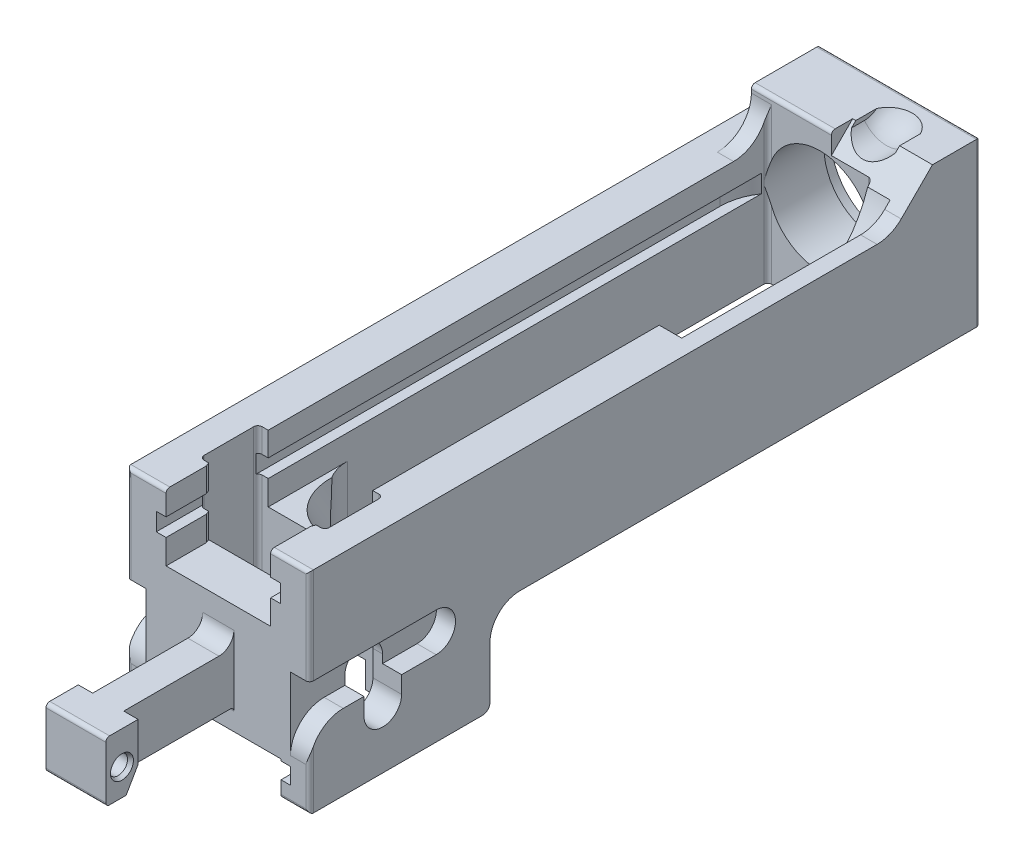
from build123d import *

# Parameters (mm, degrees)
EXTRUDE_1_DEPTH      = 19.3802
SKETCH_2_R           = 1.9812
EXTRUDE_2_DEPTH      = 3.302
SKETCH_3_R           = 1.9812
EXTRUDE_3_DEPTH      = 6.35
FILLET_1_R           = 0.79375
CUT_EXTRUDE_1_DEPTH  = 182.801214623
CUT_EXTRUDE_2_DEPTH  = 182.801214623
CUT_EXTRUDE_3_DEPTH  = 14.1224
CUT_EXTRUDE_4_REACH  = 150.552
CUT_EXTRUDE_5_DEPTH  = 3.7846
FILLET_2_R           = 0.79375
CUT_EXTRUDE_6_DEPTH  = 4.064
CHAMFER_1_SIZE       = 0.79375
CHAMFER_1_SIZE2      = 0.458271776
SKETCH_13_W          = 19.177
SKETCH_13_H          = 22.9616
CUT_EXTRUDE_8_DEPTH  = 12.827
SKETCH_14_W          = 4.826
SKETCH_14_H          = 8.763
CUT_EXTRUDE_9_DEPTH  = 178.762725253
CUT_EXTRUDE_10_DEPTH = 26.5684
SKETCH_16_R          = 23.876
CUT_EXTRUDE_11_DEPTH = 4.7752
CUT_EXTRUDE_12_DEPTH = 16.9418
CUT_EXTRUDE_13_DEPTH = 2.032
CUT_EXTRUDE_14_DEPTH = 1.3208


with BuildPart() as part:
    # Sketch 1 → Extrude 1 (new, symmetric)
    with BuildSketch(Plane(origin=(0, 0, 0), x_dir=(0, 0, -1), z_dir=(1, 0, 0))):
        with BuildLine():
            Line((-142.4178, 7.1882), (-21.8948, 7.1882))
            ThreePointArc((-21.8948, 7.1882), (-16.776054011, 9.308454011), (-14.6558, 14.4272))
            Line((-14.6558, 14.4272), (-14.6558, 15.15745))
            ThreePointArc((-14.6558, 15.15745), (-14.423316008, 15.718716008), (-13.86205, 15.9512))
            Line((-13.86205, 15.9512), (0, 15.9512))
            Line((0, 15.9512), (0, -18.5928))
            Line((0, -18.5928), (-97.7646, -18.5928))
            ThreePointArc((-97.7646, -18.5928), (-102.254728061, -20.452671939), (-104.1146, -24.9428))
            Line((-104.1146, -24.9428), (-104.1146, -35.9537))
            ThreePointArc((-104.1146, -35.9537), (-104.579567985, -37.076232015), (-105.7021, -37.5412))
            Line((-105.7021, -37.5412), (-142.4178, -37.5412))
            Line((-142.4178, -37.5412), (-142.4178, 7.1882))
        make_face()
        with BuildLine():
            Line((-130.8735, -25.0825), (-130.8735, -19.6723))
            ThreePointArc((-130.8735, -19.6723), (-126.873, -15.6718), (-122.8725, -19.6723))
            Line((-122.8725, -19.6723), (-122.8725, -25.0825))
            ThreePointArc((-122.8725, -25.0825), (-126.873, -29.083), (-130.8735, -25.0825))
        make_face(mode=Mode.SUBTRACT)
    extrude(amount=EXTRUDE_1_DEPTH, both=True)

    # Sketch 2 → Extrude 2 (add, symmetric)
    with BuildSketch(Plane(origin=(0, 0, 0), x_dir=(0, 0, -1), z_dir=(1, 0, 0))):
        with BuildLine():
            Line((-142.4178, -11.557), (-142.4178, -26.44775))
            ThreePointArc((-142.4178, -26.44775), (-142.650283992, -25.886483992), (-143.21155, -25.654))
            Line((-143.21155, -25.654), (-163.9444647, -25.654))
            ThreePointArc((-163.9444647, -25.654), (-166.320417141, -26.115252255), (-168.3512, -27.432))
            Line((-168.3512, -27.432), (-172.6692, -27.432))
            Line((-172.6692, -27.432), (-172.6692, -14.732))
            Line((-172.6692, -14.732), (-145.5928, -14.732))
            ThreePointArc((-145.5928, -14.732), (-143.34773597, -13.80206403), (-142.4178, -11.557))
        make_face()
        with Locations(Location((-169.2402, -21.7678, 0), (0, 0, 180))):
            Circle(SKETCH_2_R, mode=Mode.SUBTRACT)
    extrude(amount=EXTRUDE_2_DEPTH, both=True)

    # Sketch 3 → Extrude 3 (add, symmetric)
    with BuildSketch(Plane(origin=(0, 0, 0), x_dir=(0, 0, -1), z_dir=(1, 0, 0))):
        Polygon((-165.8112, -14.732), (-172.6692, -14.732), (-172.6692, -27.432), (-168.3512, -27.432), (-165.8112, -23.032590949), align=None)
        with Locations(Location((-169.2402, -21.7678, 0), (0, 0, 180))):
            Circle(SKETCH_3_R, mode=Mode.SUBTRACT)
    extrude(amount=EXTRUDE_3_DEPTH, both=True)

    # Fillet 1
    fillet_1_edges = [part.edges().sort_by_distance(p)[0] for p in [
        (0, -14.732, 172.6692),
        (0, -27.432, 172.6692),
    ]]
    fillet(fillet_1_edges, radius=FILLET_1_R)

    # Sketch 6 → Cut-Extrude 1 (cut, through all)
    with BuildSketch(Plane.XZ.offset(37.5412)):
        with BuildLine():
            Line((12.3952, 120.7262), (-12.3952, 120.7262))
            ThreePointArc((-12.3952, 120.7262), (-13.023817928, 120.986582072), (-13.2842, 121.6152))
            Line((-13.2842, 121.6152), (-13.2842, 132.1816))
            ThreePointArc((-13.2842, 132.1816), (-13.023817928, 132.810217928), (-12.3952, 133.0706))
            Line((-12.3952, 133.0706), (12.3952, 133.0706))
            ThreePointArc((12.3952, 133.0706), (13.023817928, 132.810217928), (13.2842, 132.1816))
            Line((13.2842, 132.1816), (13.2842, 121.6152))
            ThreePointArc((13.2842, 121.6152), (13.023817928, 120.986582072), (12.3952, 120.7262))
        make_face()
    extrude(amount=-CUT_EXTRUDE_1_DEPTH, mode=Mode.SUBTRACT)

    # Sketch 5 → Cut-Extrude 2 (cut, through all)
    with BuildSketch(Plane(origin=(0, 15.9512, 0), x_dir=(1, 0, 0), z_dir=(0, 1, 0))):
        with BuildLine():
            Line((-10.30605, -14.6558), (10.30605, -14.6558))
            ThreePointArc((10.30605, -14.6558), (10.867316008, -14.888283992), (11.0998, -15.44955))
            Line((11.0998, -15.44955), (11.0998, -103.91775))
            ThreePointArc((11.0998, -103.91775), (8.542476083, -110.091676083), (2.36855, -112.649))
            Line((2.36855, -112.649), (-2.36855, -112.649))
            ThreePointArc((-2.36855, -112.649), (-8.542476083, -110.091676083), (-11.0998, -103.91775))
            Line((-11.0998, -103.91775), (-11.0998, -15.44955))
            ThreePointArc((-11.0998, -15.44955), (-10.867316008, -14.888283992), (-10.30605, -14.6558))
        make_face()
    extrude(amount=-CUT_EXTRUDE_2_DEPTH, mode=Mode.SUBTRACT)

    # Sketch 7 → Cut-Revolve 1 (revolve, cut)
    with BuildSketch(Plane(origin=(0, 0, 0), x_dir=(0, 0, -1), z_dir=(1, 0, 0)), mode=Mode.PRIVATE) as cut_revolve_1_sk:
        Polygon((0, 0), (0, 12.3571), (-2.667, 12.3571), (-2.667, 11.10996), (-15.44955, 11.10996), (-15.44955, 0), align=None)
    revolve(cut_revolve_1_sk.sketch.rotate(Axis((0, 0, 0), (0, 0, 1)), 90), axis=Axis((0, 0, 0), (0, 0, 1)), mode=Mode.SUBTRACT)

    # Sketch 8 → Cut-Extrude 3 (cut)
    with BuildSketch(Plane(origin=(0, 7.1882, 0), x_dir=(1, 0, 0), z_dir=(0, 1, 0))):
        with BuildLine():
            Line((-11.0998, -103.91775), (11.0998, -103.91775))
            Line((11.0998, -103.91775), (11.0998, -120.7262))
            Line((11.0998, -120.7262), (11.89355, -120.7262))
            Line((11.89355, -120.7262), (11.89355, -130.057658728))
            ThreePointArc((11.89355, -130.057658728), (11.693001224, -132.001941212), (11.0998, -133.86435))
            Line((11.0998, -133.86435), (11.0998, -142.4178))
            Line((11.0998, -142.4178), (-11.0998, -142.4178))
            Line((-11.0998, -142.4178), (-11.0998, -133.86435))
            ThreePointArc((-11.0998, -133.86435), (-11.693001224, -132.001941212), (-11.89355, -130.057658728))
            Line((-11.89355, -130.057658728), (-11.89355, -120.7262))
            Line((-11.89355, -120.7262), (-11.0998, -120.7262))
            Line((-11.0998, -120.7262), (-11.0998, -103.91775))
        make_face()
    extrude(amount=-CUT_EXTRUDE_3_DEPTH, mode=Mode.SUBTRACT)

    # Cut-Extrude 4: up to this face of the body (flat: up to its plane)
    cut_extrude_4_end = Plane(part.part.faces().sort_by_distance((15.238890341, -30.44825, 104.1146))[0])
    # Sketch 9 → Cut-Extrude 4 (cut, up to the picked face)
    with BuildSketch(Plane.XY.offset(142.4178), mode=Mode.PRIVATE) as cut_extrude_4_sk1:
        Polygon((-13.3096, -30.226), (13.3096, -30.226), (13.3096, -30.607), (15.3162, -30.607), (15.3162, -34.0614), (13.3096, -34.0614), (13.3096, -37.5412), (-13.3096, -37.5412), (-13.3096, -34.0614), (-15.3162, -34.0614), (-15.3162, -30.607), (-13.3096, -30.607), align=None)
    cut_extrude_4_tool1 = split(extrude(cut_extrude_4_sk1.sketch, amount=-CUT_EXTRUDE_4_REACH, mode=Mode.PRIVATE), bisect_by=cut_extrude_4_end, keep=Keep.BOTH, mode=Mode.PRIVATE)
    add(cut_extrude_4_tool1.solids().sort_by(Axis((0, -33.780624, 142.4178), (0, 0, -1)))[0], mode=Mode.SUBTRACT)

    # Sketch 10 → Cut-Extrude 5 (cut)
    with BuildSketch(Plane(origin=(0, 2.0828, 0), x_dir=(1, 0, 0), z_dir=(0, 1, 0))):
        with BuildLine():
            Line((-10.0076, -14.6558), (10.0076, -14.6558))
            ThreePointArc((10.0076, -14.6558), (12.359884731, -18.356065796), (13.1826, -22.662845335))
            Line((13.1826, -22.662845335), (13.1826, -142.4178))
            Line((13.1826, -142.4178), (-13.1826, -142.4178))
            Line((-13.1826, -142.4178), (-13.1826, -22.662845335))
            ThreePointArc((-13.1826, -22.662845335), (-12.359884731, -18.356065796), (-10.0076, -14.6558))
        make_face()
    extrude(amount=-CUT_EXTRUDE_5_DEPTH, mode=Mode.SUBTRACT)

    # Fillet 2
    fillet_2_edges = [part.edges().sort_by_distance(p)[0] for p in [
        (19.3802, -1.3208, 0),
        (-19.3802, -15.1765, 142.4178),
        (-19.3802, -1.3208, 0),
        (16.3449, -37.5412, 142.4178),
        (15.24, 7.1882, 142.4178),
        (0, 15.9512, 0),
        (0, -18.5928, 0),
        (-15.24, 7.1882, 142.4178),
        (19.3802, -15.1765, 142.4178),
        (-16.3449, -37.5412, 142.4178),
    ]]
    fillet(fillet_2_edges, radius=FILLET_2_R)

    # Sketch 11 → Cut-Extrude 6 (cut)
    with BuildSketch(Plane(origin=(19.3802, 0, 0), x_dir=(0, 0, -1), z_dir=(1, 0, 0))):
        with BuildLine():
            Line((-142.4178, -28.60675), (-142.4178, -13.2334))
            Line((-142.4178, -13.2334), (-115.5446, -13.2334))
            ThreePointArc((-115.5446, -13.2334), (-111.4298, -17.3482), (-115.5446, -21.463))
            Line((-115.5446, -21.463), (-135.27405, -21.463))
            ThreePointArc((-135.27405, -21.463), (-140.325444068, -23.555355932), (-142.4178, -28.60675))
        make_face()
    cut_extrude_6 = extrude(amount=-CUT_EXTRUDE_6_DEPTH, mode=Mode.SUBTRACT)

    # Mirror 1: Cut-Extrude 6 across plane
    add(cut_extrude_6.mirror(Plane(origin=(0, 0, 0), x_dir=(0, 0, 1), z_dir=(1, 0, 0))), mode=Mode.SUBTRACT)

    # Chamfer 1
    chamfer_1_edges = [part.edges().sort_by_distance(p)[0] for p in [
        (-6.35, -21.7678, 167.259),
        (6.35, -21.7678, 167.259),
    ]]
    chamfer_1_side = [part.faces().sort_by_distance(p)[0] for p in [
        (0, -21.7678, 167.259),
    ]]
    chamfer(chamfer_1_edges, length=CHAMFER_1_SIZE, length2=CHAMFER_1_SIZE2, reference=chamfer_1_side[0])

    # Sketch 12 → Cut-Revolve 2 (revolve, cut)
    with BuildSketch(Plane(origin=(0, 0, 0), x_dir=(0, 0, -1), z_dir=(1, 0, 0))):
        Polygon((-111.463587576, -2.0447), (-119.93245, -6.9342), (-103.661968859, -35.1155), (-95.193106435, -30.226), align=None)
    revolve(axis=Axis((0, 11.082611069, 119.042644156), (0, -0.8660254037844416, -0.49999999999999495)), mode=Mode.SUBTRACT)

    # Sketch 13 → Cut-Extrude 8 (cut)
    with BuildSketch(Plane.XZ.offset(37.5412)):
        with Locations((0, 109.2454)):
            Rectangle(SKETCH_13_W, SKETCH_13_H)
    extrude(amount=-CUT_EXTRUDE_8_DEPTH, mode=Mode.SUBTRACT)

    # Sketch 14 → Cut-Extrude 9 (cut, through all)
    with BuildSketch(Plane(origin=(0, 0, 0), x_dir=(-1, 0, 0), z_dir=(0, 0, -1))):
        with Locations((16.9672, 11.5697)):
            Rectangle(SKETCH_14_W, SKETCH_14_H)
    extrude(amount=-CUT_EXTRUDE_9_DEPTH, mode=Mode.SUBTRACT)

    # Sketch 15 → Cut-Extrude 10 (cut)
    with BuildSketch(Plane.ZY.offset(-13.2842)):
        Polygon((132.1816, -30.226), (134.6581, -30.226), (132.1816, -27.7495), align=None)
    extrude(amount=CUT_EXTRUDE_10_DEPTH, mode=Mode.SUBTRACT)

    # Sketch 16 → Cut-Extrude 11 (cut)
    with BuildSketch(Plane.ZY.offset(-11.0998)):
        with Locations((38.4048, 17.6022)):
            Circle(SKETCH_16_R)
    extrude(amount=-CUT_EXTRUDE_11_DEPTH, mode=Mode.SUBTRACT)

    # Sketch 17 → Cut-Extrude 12 (cut)
    with BuildSketch(Plane(origin=(19.3802, 0, 0), x_dir=(0, 0, -1), z_dir=(1, 0, 0))):
        Polygon((-10.133308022, 15.9512), (-16.776054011, 15.9512), (-16.776054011, 9.308454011), align=None)
    extrude(amount=-CUT_EXTRUDE_12_DEPTH, mode=Mode.SUBTRACT)

    # Sweep 1: sweep along a path in Sketch 18
    with BuildLine(Plane.ZY.offset(-7.747)) as sweep_1_path:
        Line((14.6558, 12.7508), (8.291973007, 12.7508))
        ThreePointArc((8.291973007, 12.7508), (5.104298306, 13.608875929), (2.778125, 15.9512))
    # Sketch 19 → Sweep 1 (sweep, cut)
    with BuildSketch(Plane.XY.offset(14.6558)):
        with BuildLine():
            Line((3.0988, 15.03761073), (3.0988, 19.1008))
            Line((3.0988, 19.1008), (12.3952, 19.1008))
            Line((12.3952, 19.1008), (12.3952, 15.03761073))
            ThreePointArc((12.3952, 15.03761073), (7.747, 12.7508), (3.0988, 15.03761073))
        make_face()
    sweep(path=sweep_1_path.line, mode=Mode.SUBTRACT)

    # Sketch 20 → Cut-Extrude 13 (cut)
    with BuildSketch(Plane.ZY.offset(19.3802)):
        with BuildLine():
            Line((31.75, 4.0386), (0, 4.0386))
            Line((0, 4.0386), (0, -4.0386))
            Line((0, -4.0386), (31.75, -4.0386))
            ThreePointArc((31.75, -4.0386), (33.070555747, -3.816598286), (34.245929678, -3.175))
            Line((34.245929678, -3.175), (51.0032, -3.175))
            ThreePointArc((51.0032, -3.175), (54.1782, 0), (51.0032, 3.175))
            Line((51.0032, 3.175), (34.245929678, 3.175))
            ThreePointArc((34.245929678, 3.175), (33.070555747, 3.816598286), (31.75, 4.0386))
        make_face()
    extrude(amount=-CUT_EXTRUDE_13_DEPTH, mode=Mode.SUBTRACT)

    # Sketch 21 → Cut-Extrude 14 (cut)
    with BuildSketch(Plane.ZY.offset(17.3482)):
        with BuildLine():
            Line((51.0032, 4.0386), (0, 4.0386))
            Line((0, 4.0386), (0, -4.0386))
            Line((0, -4.0386), (51.0032, -4.0386))
            ThreePointArc((51.0032, -4.0386), (55.0418, 0), (51.0032, 4.0386))
        make_face()
    extrude(amount=CUT_EXTRUDE_14_DEPTH, mode=Mode.SUBTRACT)


solid = part.part
